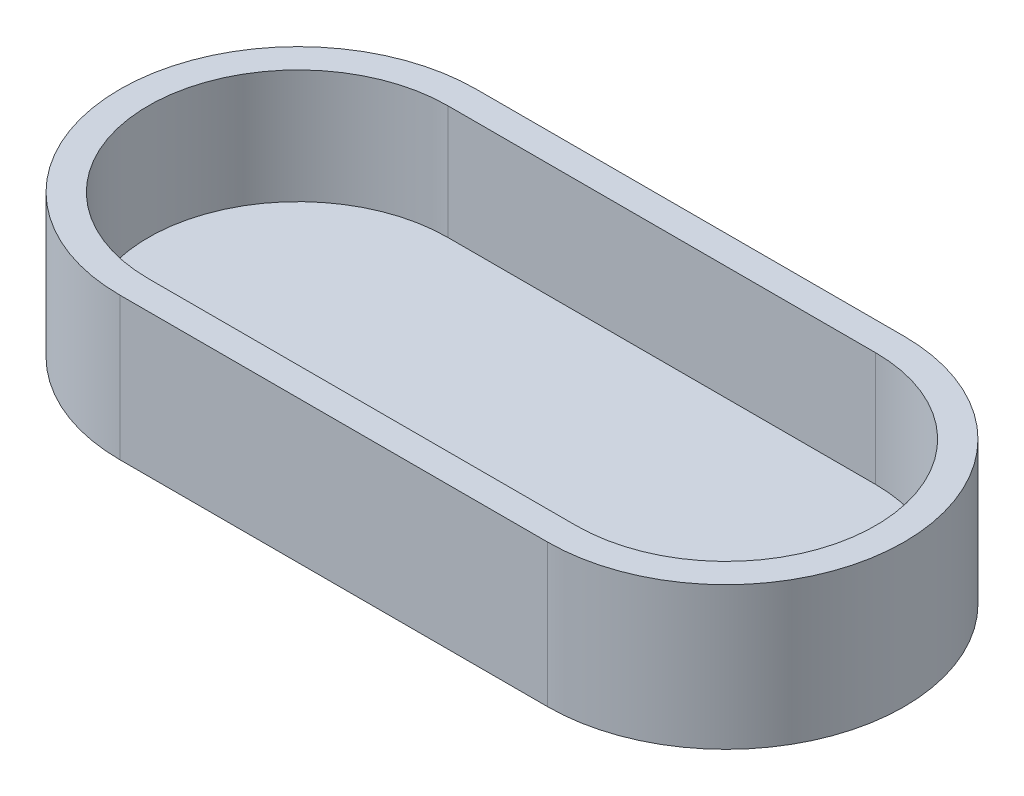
from build123d import *

# Parameters (mm, degrees)
EXTRUDE1_DEPTH = 20
SHELL1_T       = -4


with BuildPart() as part:
    # Sketch2 → Extrude1 (new body)
    with BuildSketch(Plane(origin=(0, 0, 0), x_dir=(1, 0, 0), z_dir=(0, 1, 0))):
        with BuildLine():
            Line((0, 0), (60, 0))
            ThreePointArc((60, 0), (85, 25), (60, 50))
            Line((60, 50), (0, 50))
            ThreePointArc((0, 50), (-25, 25), (0, 0))
        make_face()
    extrude(amount=EXTRUDE1_DEPTH)

    # Shell1
    shell1_openings = [part.faces().sort_by_distance(p)[0] for p in [
        (30, 20, -25),
    ]]
    offset(amount=SHELL1_T, openings=shell1_openings, kind=Kind.INTERSECTION)


solid = part.part
